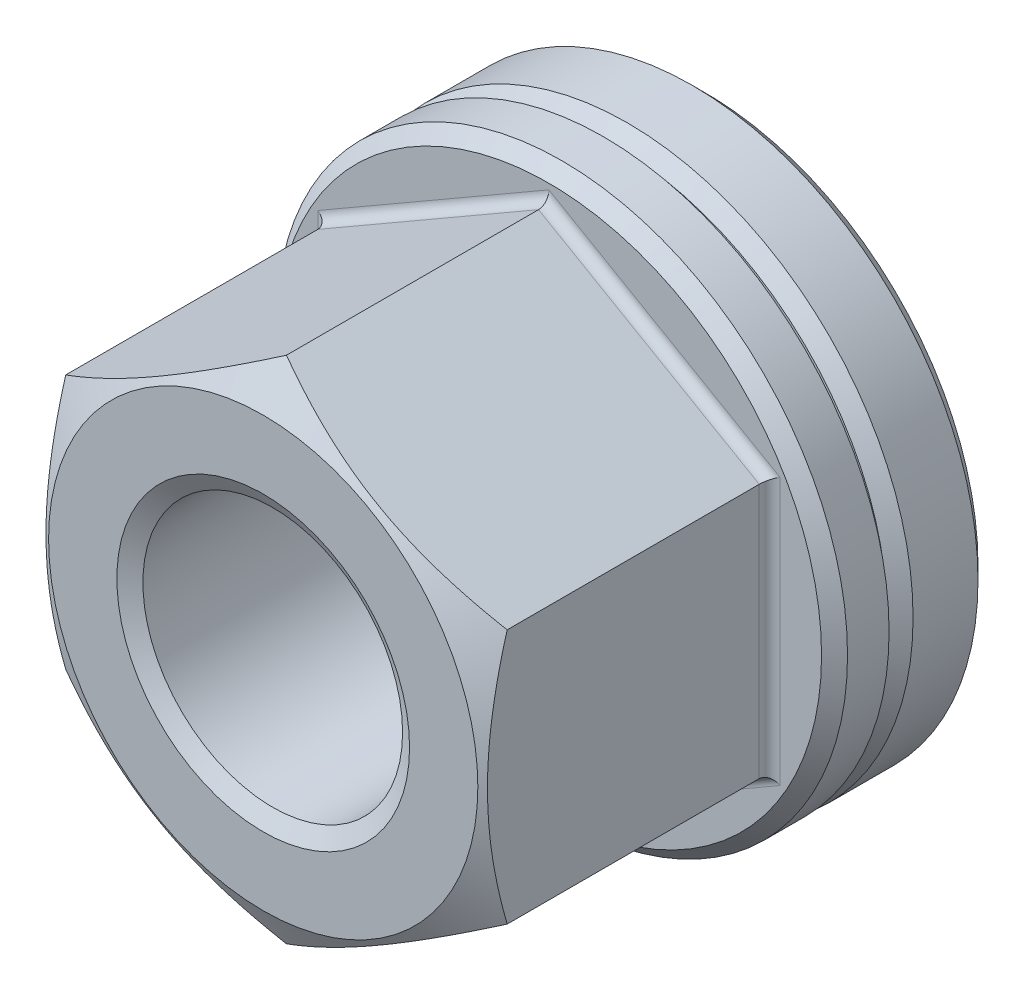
ISO-10303-21;
HEADER;
FILE_DESCRIPTION(('STEP AP214'),'2;1');
FILE_NAME('part.step','',(''),(''),'','','');
FILE_SCHEMA(('AUTOMOTIVE_DESIGN { 1 0 10303 214 1 1 1 1 }'));
ENDSEC;
DATA;
#1=APPLICATION_CONTEXT('core data for automotive mechanical design processes');
#2=APPLICATION_PROTOCOL_DEFINITION('international standard','automotive_design',2000,#1);
#3=PRODUCT_CONTEXT('',#1,'mechanical');
#4=PRODUCT('Part','Part','',(#3));
#5=PRODUCT_RELATED_PRODUCT_CATEGORY('part','',(#4));
#6=PRODUCT_DEFINITION_FORMATION('','',#4);
#7=PRODUCT_DEFINITION_CONTEXT('part definition',#1,'design');
#8=PRODUCT_DEFINITION('design','',#6,#7);
#9=PRODUCT_DEFINITION_SHAPE('','',#8);
#10=(LENGTH_UNIT() NAMED_UNIT(*) SI_UNIT(.MILLI.,.METRE.));
#11=(NAMED_UNIT(*) PLANE_ANGLE_UNIT() SI_UNIT($,.RADIAN.));
#12=(NAMED_UNIT(*) SI_UNIT($,.STERADIAN.) SOLID_ANGLE_UNIT());
#13=UNCERTAINTY_MEASURE_WITH_UNIT(LENGTH_MEASURE(1.E-05),#10,'distance_accuracy_value','');
#14=(GEOMETRIC_REPRESENTATION_CONTEXT(3) GLOBAL_UNCERTAINTY_ASSIGNED_CONTEXT((#13)) GLOBAL_UNIT_ASSIGNED_CONTEXT((#10,
#11,#12)) REPRESENTATION_CONTEXT('',''));
#15=CARTESIAN_POINT('',(0.,0.,0.));
#16=DIRECTION('',(0.,0.,1.));
#17=DIRECTION('',(1.,0.,0.));
#18=AXIS2_PLACEMENT_3D('',#15,#16,#17);
#19=CARTESIAN_POINT('',(0.,0.,26.3737494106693));
#20=DIRECTION('',(0.,0.,-1.));
#21=DIRECTION('',(0.,1.,0.));
#22=AXIS2_PLACEMENT_3D('',#19,#20,#21);
#23=SPHERICAL_SURFACE('',#22,25.);
#24=CARTESIAN_POINT('',(0.,0.,2.0238050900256));
#25=DIRECTION('',(0.,0.,-1.));
#26=DIRECTION('',(-1.,0.,0.));
#27=AXIS2_PLACEMENT_3D('',#24,#25,#26);
#28=CIRCLE('',#27,5.66393958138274);
#29=CARTESIAN_POINT('',(0.,5.66393958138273,2.0238050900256));
#30=VERTEX_POINT('',#29);
#31=EDGE_CURVE('E597',#30,#30,#28,.T.);
#32=CARTESIAN_POINT('',(0.,0.,2.23353400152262));
#33=DIRECTION('',(0.,0.,1.));
#34=DIRECTION('',(1.,0.,0.));
#35=AXIS2_PLACEMENT_3D('',#32,#33,#34);
#36=CIRCLE('',#35,6.5);
#37=CARTESIAN_POINT('',(0.,6.49999999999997,2.23353400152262));
#38=VERTEX_POINT('',#37);
#39=EDGE_CURVE('E23',#38,#38,#36,.T.);
#40=CARTESIAN_POINT('',(0.,5.66393958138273,2.0238050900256));
#41=CARTESIAN_POINT('',(0.,5.67268534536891,2.02583940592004));
#42=CARTESIAN_POINT('',(0.,5.68143001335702,2.02787843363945));
#43=CARTESIAN_POINT('',(0.,5.69891714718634,2.0319659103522));
#44=CARTESIAN_POINT('',(0.,5.70765961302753,2.03401435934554));
#45=CARTESIAN_POINT('',(0.,5.72514233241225,2.03812067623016));
#46=CARTESIAN_POINT('',(0.,5.73388258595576,2.04017854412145));
#47=CARTESIAN_POINT('',(0.,5.75136087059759,2.04430369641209));
#48=CARTESIAN_POINT('',(0.,5.76009890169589,2.04637098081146));
#49=CARTESIAN_POINT('',(0.,5.77757273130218,2.05051496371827));
#50=CARTESIAN_POINT('',(0.,5.78630852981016,2.05259166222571));
#51=CARTESIAN_POINT('',(0.,5.80377788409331,2.05675447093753));
#52=CARTESIAN_POINT('',(0.,5.81251143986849,2.0588405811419));
#53=CARTESIAN_POINT('',(0.,5.82997629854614,2.06302221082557));
#54=CARTESIAN_POINT('',(0.,5.83870760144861,2.06511773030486));
#55=CARTESIAN_POINT('',(0.,5.85616794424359,2.06931817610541));
#56=CARTESIAN_POINT('',(0.,5.8648969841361,2.07142310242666));
#57=CARTESIAN_POINT('',(0.,5.8823527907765,2.07564235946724));
#58=CARTESIAN_POINT('',(0.,5.8910795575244,2.07775669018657));
#59=CARTESIAN_POINT('',(0.,5.90853080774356,2.08199475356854));
#60=CARTESIAN_POINT('',(0.,5.91725529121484,2.08411848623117));
#61=CARTESIAN_POINT('',(0.,5.93470196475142,2.08837535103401));
#62=CARTESIAN_POINT('',(0.,5.94342415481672,2.09050848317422));
#63=CARTESIAN_POINT('',(0.,5.96086623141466,2.09478414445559));
#64=CARTESIAN_POINT('',(0.,5.9695861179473,2.09692667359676));
#65=CARTESIAN_POINT('',(0.,5.9870235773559,2.10122112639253));
#66=CARTESIAN_POINT('',(0.,5.99574115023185,2.10337305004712));
#67=CARTESIAN_POINT('',(0.,6.01317397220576,2.10768628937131));
#68=CARTESIAN_POINT('',(0.,6.02188922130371,2.10984760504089));
#69=CARTESIAN_POINT('',(0.,6.03931738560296,2.11417962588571));
#70=CARTESIAN_POINT('',(0.,6.04803030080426,2.11635033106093));
#71=CARTESIAN_POINT('',(0.,6.0654537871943,2.12070112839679));
#72=CARTESIAN_POINT('',(0.,6.07416435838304,2.12288122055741));
#73=CARTESIAN_POINT('',(0.,6.09158314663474,2.12725078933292));
#74=CARTESIAN_POINT('',(0.,6.10029136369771,2.1294402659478));
#75=CARTESIAN_POINT('',(0.,6.11770543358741,2.13382860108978));
#76=CARTESIAN_POINT('',(0.,6.12641128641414,2.13602745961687));
#77=CARTESIAN_POINT('',(0.,6.14382061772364,2.14043455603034));
#78=CARTESIAN_POINT('',(0.,6.15252409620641,2.14264279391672));
#79=CARTESIAN_POINT('',(0.,6.16992866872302,2.14706864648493));
#80=CARTESIAN_POINT('',(0.,6.17862976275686,2.14928626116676));
#81=CARTESIAN_POINT('',(0.,6.19602955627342,2.15373086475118));
#82=CARTESIAN_POINT('',(0.,6.20472825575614,2.15595785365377));
#83=CARTESIAN_POINT('',(0.,6.22212325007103,2.1604212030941));
#84=CARTESIAN_POINT('',(0.,6.2308195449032,2.16265756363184));
#85=CARTESIAN_POINT('',(0.,6.24820971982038,2.16713965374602));
#86=CARTESIAN_POINT('',(0.,6.25690359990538,2.16938538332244));
#87=CARTESIAN_POINT('',(0.,6.2742889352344,2.17388620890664));
#88=CARTESIAN_POINT('',(0.,6.2829803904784,2.1761413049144));
#89=CARTESIAN_POINT('',(0.,6.30036086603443,2.18066086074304));
#90=CARTESIAN_POINT('',(0.,6.30904988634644,2.18292532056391));
#91=CARTESIAN_POINT('',(0.,6.32642548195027,2.18746360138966));
#92=CARTESIAN_POINT('',(0.,6.3351120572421,2.18973742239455));
#93=CARTESIAN_POINT('',(0.,6.35248275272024,2.19429442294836));
#94=CARTESIAN_POINT('',(0.,6.36116687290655,2.19657760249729));
#95=CARTESIAN_POINT('',(0.,6.37853264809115,2.20115331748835));
#96=CARTESIAN_POINT('',(0.,6.38721430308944,2.20344585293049));
#97=CARTESIAN_POINT('',(0.,6.40457513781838,2.20804027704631));
#98=CARTESIAN_POINT('',(0.,6.41325431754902,2.21034216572));
#99=CARTESIAN_POINT('',(0.,6.43061019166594,2.21495529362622));
#100=CARTESIAN_POINT('',(0.,6.43928688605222,2.21726653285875));
#101=CARTESIAN_POINT('',(0.,6.45663777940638,2.22189835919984));
#102=CARTESIAN_POINT('',(0.,6.46531197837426,2.22421894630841));
#103=CARTESIAN_POINT('',(0.,6.48265787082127,2.22886946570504));
#104=CARTESIAN_POINT('',(0.,6.4913295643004,2.2311993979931));
#105=CARTESIAN_POINT('',(0.,6.49999999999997,2.23353400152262));
#106=B_SPLINE_CURVE_WITH_KNOTS('',3,(#40,#41,#42,#43,#44,#45,#46,#47,#48,#49,#50,#51,#52,#53,
#54,#55,#56,#57,#58,#59,#60,#61,#62,#63,#64,#65,#66,#67,#68,#69,#70,#71,#72,#73,#74,#75,#76,#77,
#78,#79,#80,#81,#82,#83,#84,#85,#86,#87,#88,#89,#90,#91,#92,#93,#94,#95,#96,#97,#98,#99,#100,
#101,#102,#103,#104,#105),.UNSPECIFIED.,.F.,.F.,(4,2,2,2,2,2,2,2,2,2,2,2,2,2,2,2,2,2,2,2,2,2,2,
2,2,2,2,2,2,2,2,2,4),(0.,0.0269377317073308,0.0538754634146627,0.0808131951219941,
0.107750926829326,0.134688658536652,0.161626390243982,0.188564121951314,0.215501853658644,
0.242439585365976,0.269377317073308,0.296315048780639,0.323252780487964,0.350190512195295,
0.377128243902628,0.404065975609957,0.431003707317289,0.45794143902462,0.484879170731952,
0.511816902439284,0.538754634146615,0.565692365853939,0.592630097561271,0.619567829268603,
0.646505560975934,0.673443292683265,0.700381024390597,0.727318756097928,0.754256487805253,
0.781194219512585,0.808131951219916,0.835069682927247,0.862007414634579),.UNSPECIFIED.);
#107=EDGE_CURVE('BSEAM14',#30,#38,#106,.T.);
#108=ORIENTED_EDGE('',*,*,#31,.F.);
#109=ORIENTED_EDGE('',*,*,#39,.F.);
#110=ORIENTED_EDGE('',*,*,#107,.T.);
#111=ORIENTED_EDGE('',*,*,#107,.F.);
#112=EDGE_LOOP('',(#108,#110,#109,#111));
#113=FACE_BOUND('',#112,.T.);
#114=ADVANCED_FACE('F14',(#113),#23,.T.);
#115=CARTESIAN_POINT('',(0.,0.,6.0238050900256));
#116=DIRECTION('',(0.,0.,1.));
#117=DIRECTION('',(1.,0.,0.));
#118=AXIS2_PLACEMENT_3D('',#115,#116,#117);
#119=PLANE('',#118);
#120=DIRECTION('',(0.,-1.,0.));
#121=VECTOR('',#120,1.);
#122=CARTESIAN_POINT('',(-8.9,0.,6.0238050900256));
#123=LINE('',#122,#121);
#124=CARTESIAN_POINT('',(-8.9,-5.13841739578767,6.0238050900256));
#125=VERTEX_POINT('',#124);
#126=CARTESIAN_POINT('',(-8.9,5.13841739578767,6.0238050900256));
#127=VERTEX_POINT('',#126);
#128=EDGE_CURVE('E142',#125,#127,#123,.F.);
#129=ORIENTED_EDGE('',*,*,#128,.T.);
#130=DIRECTION('',(-0.866025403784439,-0.5,0.));
#131=VECTOR('',#130,1.);
#132=CARTESIAN_POINT('',(-4.45,7.70762609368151,6.0238050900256));
#133=LINE('',#132,#131);
#134=CARTESIAN_POINT('',(0.,10.2768347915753,6.0238050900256));
#135=VERTEX_POINT('',#134);
#136=EDGE_CURVE('E144',#127,#135,#133,.F.);
#137=ORIENTED_EDGE('',*,*,#136,.T.);
#138=DIRECTION('',(-0.866025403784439,0.5,0.));
#139=VECTOR('',#138,1.);
#140=CARTESIAN_POINT('',(4.45,7.70762609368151,6.0238050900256));
#141=LINE('',#140,#139);
#142=CARTESIAN_POINT('',(8.9,5.13841739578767,6.0238050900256));
#143=VERTEX_POINT('',#142);
#144=EDGE_CURVE('E134',#135,#143,#141,.F.);
#145=ORIENTED_EDGE('',*,*,#144,.T.);
#146=DIRECTION('',(0.,1.,0.));
#147=VECTOR('',#146,1.);
#148=CARTESIAN_POINT('',(8.9,0.,6.0238050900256));
#149=LINE('',#148,#147);
#150=CARTESIAN_POINT('',(8.9,-5.13841739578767,6.0238050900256));
#151=VERTEX_POINT('',#150);
#152=EDGE_CURVE('E136',#143,#151,#149,.F.);
#153=ORIENTED_EDGE('',*,*,#152,.T.);
#154=DIRECTION('',(0.866025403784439,0.5,0.));
#155=VECTOR('',#154,1.);
#156=CARTESIAN_POINT('',(4.45,-7.7076260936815,6.0238050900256));
#157=LINE('',#156,#155);
#158=CARTESIAN_POINT('',(0.,-10.2768347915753,6.0238050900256));
#159=VERTEX_POINT('',#158);
#160=EDGE_CURVE('E138',#151,#159,#157,.F.);
#161=ORIENTED_EDGE('',*,*,#160,.T.);
#162=DIRECTION('',(0.866025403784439,-0.5,0.));
#163=VECTOR('',#162,1.);
#164=CARTESIAN_POINT('',(-4.45,-7.7076260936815,6.0238050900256));
#165=LINE('',#164,#163);
#166=EDGE_CURVE('E140',#159,#125,#165,.F.);
#167=ORIENTED_EDGE('',*,*,#166,.T.);
#168=EDGE_LOOP('',(#129,#137,#145,#153,#161,#167));
#169=FACE_BOUND('',#168,.T.);
#170=CARTESIAN_POINT('',(0.,0.,6.0238050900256));
#171=DIRECTION('',(0.,0.,1.));
#172=DIRECTION('',(1.,0.,0.));
#173=AXIS2_PLACEMENT_3D('',#170,#171,#172);
#174=CIRCLE('',#173,10.5);
#175=CARTESIAN_POINT('',(10.5,0.,6.0238050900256));
#176=VERTEX_POINT('',#175);
#177=EDGE_CURVE('E116',#176,#176,#174,.T.);
#178=ORIENTED_EDGE('',*,*,#177,.T.);
#179=EDGE_LOOP('',(#178));
#180=FACE_BOUND('',#179,.T.);
#181=ADVANCED_FACE('F508',(#169,#180),#119,.T.);
#182=CARTESIAN_POINT('',(0.,0.,6.0238050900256));
#183=DIRECTION('',(0.,0.,-1.));
#184=DIRECTION('',(-1.,0.,0.));
#185=AXIS2_PLACEMENT_3D('',#182,#183,#184);
#186=CYLINDRICAL_SURFACE('',#185,11.);
#187=CARTESIAN_POINT('',(0.,0.,5.5238050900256));
#188=DIRECTION('',(0.,0.,1.));
#189=DIRECTION('',(1.,0.,0.));
#190=AXIS2_PLACEMENT_3D('',#187,#188,#189);
#191=CIRCLE('',#190,11.);
#192=CARTESIAN_POINT('',(11.,0.,5.5238050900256));
#193=VERTEX_POINT('',#192);
#194=EDGE_CURVE('E124',#193,#193,#191,.F.);
#195=ORIENTED_EDGE('',*,*,#194,.T.);
#196=EDGE_LOOP('',(#195));
#197=FACE_BOUND('',#196,.T.);
#198=CARTESIAN_POINT('',(0.,0.,3.9238050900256));
#199=DIRECTION('',(0.,0.,-1.));
#200=DIRECTION('',(-1.,0.,0.));
#201=AXIS2_PLACEMENT_3D('',#198,#199,#200);
#202=CIRCLE('',#201,11.);
#203=CARTESIAN_POINT('',(0.,11.,3.9238050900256));
#204=VERTEX_POINT('',#203);
#205=EDGE_CURVE('E172',#204,#204,#202,.T.);
#206=ORIENTED_EDGE('',*,*,#205,.F.);
#207=EDGE_LOOP('',(#206));
#208=FACE_BOUND('',#207,.T.);
#209=ADVANCED_FACE('F498',(#197,#208),#186,.T.);
#210=CARTESIAN_POINT('',(8.5,4.90747728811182,17.0238050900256));
#211=DIRECTION('',(-0.5,-0.866025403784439,0.));
#212=DIRECTION('',(0.866025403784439,-0.5,0.));
#213=AXIS2_PLACEMENT_3D('',#210,#211,#212);
#214=PLANE('',#213);
#215=DIRECTION('',(0.,0.,-1.));
#216=VECTOR('',#215,1.);
#217=CARTESIAN_POINT('',(8.5,4.90747728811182,17.0238050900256));
#218=LINE('',#217,#216);
#219=CARTESIAN_POINT('',(8.5,4.90747728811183,16.1289121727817));
#220=VERTEX_POINT('',#219);
#221=CARTESIAN_POINT('',(8.5,4.90747728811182,6.4238050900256));
#222=VERTEX_POINT('',#221);
#223=EDGE_CURVE('E575',#220,#222,#218,.T.);
#224=ORIENTED_EDGE('',*,*,#223,.T.);
#225=DIRECTION('',(-0.866025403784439,0.5,0.));
#226=VECTOR('',#225,1.);
#227=CARTESIAN_POINT('',(8.5,4.90747728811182,6.4238050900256));
#228=LINE('',#227,#226);
#229=CARTESIAN_POINT('',(0.,9.81495457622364,6.4238050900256));
#230=VERTEX_POINT('',#229);
#231=EDGE_CURVE('E153',#222,#230,#228,.T.);
#232=ORIENTED_EDGE('',*,*,#231,.T.);
#233=DIRECTION('',(0.,0.,-1.));
#234=VECTOR('',#233,1.);
#235=CARTESIAN_POINT('',(0.,9.81495457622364,17.0238050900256));
#236=LINE('',#235,#234);
#237=CARTESIAN_POINT('',(0.,9.81495457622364,16.1289121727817));
#238=VERTEX_POINT('',#237);
#239=EDGE_CURVE('E114',#238,#230,#236,.T.);
#240=ORIENTED_EDGE('',*,*,#239,.F.);
#241=CARTESIAN_POINT('',(-0.000200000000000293,9.81507004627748,16.1288455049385));
#242=CARTESIAN_POINT('',(0.186639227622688,9.70719836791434,16.1911154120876));
#243=CARTESIAN_POINT('',(0.374175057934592,9.59892450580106,16.2505592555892));
#244=CARTESIAN_POINT('',(0.750769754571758,9.3814974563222,16.3630164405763));
#245=CARTESIAN_POINT('',(0.939829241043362,9.27234391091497,16.4160270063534));
#246=CARTESIAN_POINT('',(1.51003475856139,8.94313560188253,16.5643681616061));
#247=CARTESIAN_POINT('',(1.89343164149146,8.72178130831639,16.6487426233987));
#248=CARTESIAN_POINT('',(2.46717766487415,8.39052888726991,16.7476815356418));
#249=CARTESIAN_POINT('',(2.65581276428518,8.28162036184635,16.7758663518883));
#250=CARTESIAN_POINT('',(3.0339360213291,8.06331079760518,16.8231274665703));
#251=CARTESIAN_POINT('',(3.22342410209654,7.95390980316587,16.8422045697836));
#252=CARTESIAN_POINT('',(3.6027265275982,7.73491944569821,16.8707667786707));
#253=CARTESIAN_POINT('',(3.79254025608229,7.62533043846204,16.8802627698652));
#254=CARTESIAN_POINT('',(4.17234305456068,7.40605119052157,16.8894591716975));
#255=CARTESIAN_POINT('',(4.36233211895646,7.29636095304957,16.8891598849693));
#256=CARTESIAN_POINT('',(4.71752301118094,7.09129139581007,16.879447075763));
#257=CARTESIAN_POINT('',(4.88274990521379,6.99589760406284,16.871218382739));
#258=CARTESIAN_POINT('',(5.21281671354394,6.80533344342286,16.8475123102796));
#259=CARTESIAN_POINT('',(5.37765660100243,6.71016309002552,16.8320344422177));
#260=CARTESIAN_POINT('',(5.87153810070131,6.4250204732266,16.7750929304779));
#261=CARTESIAN_POINT('',(6.19970550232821,6.23555293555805,16.7231284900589));
#262=CARTESIAN_POINT('',(6.85952142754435,5.8546080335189,16.5932166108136));
#263=CARTESIAN_POINT('',(7.19108574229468,5.66317928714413,16.5147184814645));
#264=CARTESIAN_POINT('',(7.84926989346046,5.28317649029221,16.3365602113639));
#265=CARTESIAN_POINT('',(8.17589815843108,5.09459757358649,16.2369419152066));
#266=CARTESIAN_POINT('',(8.5002,4.90736181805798,16.1288455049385));
#267=B_SPLINE_CURVE_WITH_KNOTS('',3,(#241,#242,#243,#244,#245,#246,#247,#248,#249,#250,#251,
#252,#253,#254,#255,#256,#257,#258,#259,#260,#261,#262,#263,#264,#265,#266),.UNSPECIFIED.,.F.,
.F.,(4,2,2,2,2,2,2,2,2,2,2,2,4),(0.,0.673596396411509,1.34748239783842,2.69805431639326,
3.356799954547,4.01548737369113,4.67342558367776,5.33134346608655,5.90409556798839,
6.47688628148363,7.62328361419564,8.79510569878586,9.96462743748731),.UNSPECIFIED.);
#268=EDGE_CURVE('E95',#238,#220,#267,.T.);
#269=ORIENTED_EDGE('',*,*,#268,.T.);
#270=EDGE_LOOP('',(#224,#232,#240,#269));
#271=FACE_BOUND('',#270,.T.);
#272=ADVANCED_FACE('F489',(#271),#214,.F.);
#273=CARTESIAN_POINT('',(0.,9.81495457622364,17.0238050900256));
#274=DIRECTION('',(0.5,-0.866025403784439,0.));
#275=DIRECTION('',(0.866025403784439,0.5,0.));
#276=AXIS2_PLACEMENT_3D('',#273,#274,#275);
#277=PLANE('',#276);
#278=ORIENTED_EDGE('',*,*,#239,.T.);
#279=DIRECTION('',(-0.866025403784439,-0.5,0.));
#280=VECTOR('',#279,1.);
#281=CARTESIAN_POINT('',(0.,9.81495457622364,6.4238050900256));
#282=LINE('',#281,#280);
#283=CARTESIAN_POINT('',(-8.5,4.90747728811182,6.4238050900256));
#284=VERTEX_POINT('',#283);
#285=EDGE_CURVE('E113',#230,#284,#282,.T.);
#286=ORIENTED_EDGE('',*,*,#285,.T.);
#287=DIRECTION('',(0.,0.,-1.));
#288=VECTOR('',#287,1.);
#289=CARTESIAN_POINT('',(-8.5,4.90747728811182,17.0238050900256));
#290=LINE('',#289,#288);
#291=CARTESIAN_POINT('',(-8.5,4.90747728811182,16.1289121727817));
#292=VERTEX_POINT('',#291);
#293=EDGE_CURVE('E105',#292,#284,#290,.T.);
#294=ORIENTED_EDGE('',*,*,#293,.F.);
#295=CARTESIAN_POINT('',(-8.5002,4.90736181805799,16.1288455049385));
#296=CARTESIAN_POINT('',(-8.31336077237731,5.01523349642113,16.1911154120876));
#297=CARTESIAN_POINT('',(-8.1258249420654,5.12350735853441,16.2505592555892));
#298=CARTESIAN_POINT('',(-7.74923024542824,5.34093440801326,16.3630164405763));
#299=CARTESIAN_POINT('',(-7.56017075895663,5.45008795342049,16.4160270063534));
#300=CARTESIAN_POINT('',(-6.9899652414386,5.77929626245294,16.5643681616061));
#301=CARTESIAN_POINT('',(-6.60656835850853,6.00065055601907,16.6487426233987));
#302=CARTESIAN_POINT('',(-6.03282233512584,6.33190297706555,16.7476815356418));
#303=CARTESIAN_POINT('',(-5.84418723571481,6.44081150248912,16.7758663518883));
#304=CARTESIAN_POINT('',(-5.46606397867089,6.65912106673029,16.8231274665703));
#305=CARTESIAN_POINT('',(-5.27657589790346,6.76852206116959,16.8422045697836));
#306=CARTESIAN_POINT('',(-4.8972734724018,6.98751241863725,16.8707667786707));
#307=CARTESIAN_POINT('',(-4.70745974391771,7.09710142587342,16.8802627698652));
#308=CARTESIAN_POINT('',(-4.32765694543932,7.3163806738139,16.8894591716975));
#309=CARTESIAN_POINT('',(-4.13766788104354,7.42607091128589,16.8891598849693));
#310=CARTESIAN_POINT('',(-3.78247698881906,7.63114046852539,16.879447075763));
#311=CARTESIAN_POINT('',(-3.61725009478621,7.72653426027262,16.871218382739));
#312=CARTESIAN_POINT('',(-3.28718328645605,7.9170984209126,16.8475123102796));
#313=CARTESIAN_POINT('',(-3.12234339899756,8.01226877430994,16.8320344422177));
#314=CARTESIAN_POINT('',(-2.62846189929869,8.29741139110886,16.7750929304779));
#315=CARTESIAN_POINT('',(-2.30029449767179,8.48687892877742,16.7231284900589));
#316=CARTESIAN_POINT('',(-1.64047857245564,8.86782383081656,16.5932166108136));
#317=CARTESIAN_POINT('',(-1.30891425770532,9.05925257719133,16.5147184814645));
#318=CARTESIAN_POINT('',(-0.650730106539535,9.43925537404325,16.3365602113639));
#319=CARTESIAN_POINT('',(-0.324101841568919,9.62783429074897,16.2369419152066));
#320=CARTESIAN_POINT('',(0.00019999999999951,9.81507004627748,16.1288455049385));
#321=B_SPLINE_CURVE_WITH_KNOTS('',3,(#295,#296,#297,#298,#299,#300,#301,#302,#303,#304,#305,
#306,#307,#308,#309,#310,#311,#312,#313,#314,#315,#316,#317,#318,#319,#320),.UNSPECIFIED.,.F.,
.F.,(4,2,2,2,2,2,2,2,2,2,2,2,4),(0.,0.673596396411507,1.34748239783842,2.69805431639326,
3.356799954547,4.01548737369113,4.67342558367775,5.33134346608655,5.90409556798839,
6.47688628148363,7.62328361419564,8.79510569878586,9.96462743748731),.UNSPECIFIED.);
#322=EDGE_CURVE('E89',#292,#238,#321,.T.);
#323=ORIENTED_EDGE('',*,*,#322,.T.);
#324=EDGE_LOOP('',(#278,#286,#294,#323));
#325=FACE_BOUND('',#324,.T.);
#326=ADVANCED_FACE('F111',(#325),#277,.F.);
#327=CARTESIAN_POINT('',(-8.5,4.90747728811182,17.0238050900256));
#328=DIRECTION('',(1.,0.,0.));
#329=DIRECTION('',(0.,0.,-1.));
#330=AXIS2_PLACEMENT_3D('',#327,#328,#329);
#331=PLANE('',#330);
#332=ORIENTED_EDGE('',*,*,#293,.T.);
#333=DIRECTION('',(0.,-1.,0.));
#334=VECTOR('',#333,1.);
#335=CARTESIAN_POINT('',(-8.5,4.90747728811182,6.4238050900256));
#336=LINE('',#335,#334);
#337=CARTESIAN_POINT('',(-8.5,-4.90747728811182,6.4238050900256));
#338=VERTEX_POINT('',#337);
#339=EDGE_CURVE('E147',#284,#338,#336,.T.);
#340=ORIENTED_EDGE('',*,*,#339,.T.);
#341=DIRECTION('',(0.,0.,-1.));
#342=VECTOR('',#341,1.);
#343=CARTESIAN_POINT('',(-8.5,-4.90747728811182,17.0238050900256));
#344=LINE('',#343,#342);
#345=CARTESIAN_POINT('',(-8.5,-4.90747728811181,16.1289121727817));
#346=VERTEX_POINT('',#345);
#347=EDGE_CURVE('E107',#346,#338,#344,.T.);
#348=ORIENTED_EDGE('',*,*,#347,.F.);
#349=CARTESIAN_POINT('',(-8.5,-12.9965401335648,12.829716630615));
#350=CARTESIAN_POINT('',(-8.5,-12.6234881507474,13.0099177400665));
#351=CARTESIAN_POINT('',(-8.5,-12.2495520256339,13.1883217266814));
#352=CARTESIAN_POINT('',(-8.5,-11.499433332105,13.5405080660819));
#353=CARTESIAN_POINT('',(-8.5,-11.1232503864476,13.7142896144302));
#354=CARTESIAN_POINT('',(-8.5,-10.3661184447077,14.0571233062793));
#355=CARTESIAN_POINT('',(-8.5,-9.98515448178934,14.2261425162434));
#356=CARTESIAN_POINT('',(-8.5,-9.2200884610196,14.5568940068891));
#357=CARTESIAN_POINT('',(-8.5,-8.83598656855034,14.7186266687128));
#358=CARTESIAN_POINT('',(-8.5,-8.0593528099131,15.0347508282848));
#359=CARTESIAN_POINT('',(-8.5,-7.66677513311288,15.1890304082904));
#360=CARTESIAN_POINT('',(-8.5,-6.87698368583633,15.4854594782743));
#361=CARTESIAN_POINT('',(-8.5,-6.47976940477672,15.6276076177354));
#362=CARTESIAN_POINT('',(-8.5,-5.68089003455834,15.8959400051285));
#363=CARTESIAN_POINT('',(-8.5,-5.27923652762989,16.0221583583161));
#364=CARTESIAN_POINT('',(-8.5,-4.47023474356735,16.2545220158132));
#365=CARTESIAN_POINT('',(-8.5,-4.06288831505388,16.3606736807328));
#366=CARTESIAN_POINT('',(-8.5,-3.24214687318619,16.5477324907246));
#367=CARTESIAN_POINT('',(-8.5,-2.82875005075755,16.6286319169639));
#368=CARTESIAN_POINT('',(-8.5,-2.20503353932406,16.7269802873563));
#369=CARTESIAN_POINT('',(-8.5,-1.99649903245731,16.7559317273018));
#370=CARTESIAN_POINT('',(-8.5,-1.57845804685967,16.8055978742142));
#371=CARTESIAN_POINT('',(-8.5,-1.36895166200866,16.8263133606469));
#372=CARTESIAN_POINT('',(-8.5,-0.95056931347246,16.8589508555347));
#373=CARTESIAN_POINT('',(-8.5,-0.741697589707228,16.8709269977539));
#374=CARTESIAN_POINT('',(-8.5,-0.323634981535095,16.8860228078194));
#375=CARTESIAN_POINT('',(-8.5,-0.114444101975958,16.8891426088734));
#376=CARTESIAN_POINT('',(-8.5,0.303822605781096,16.8864515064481));
#377=CARTESIAN_POINT('',(-8.5,0.512898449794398,16.880643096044));
#378=CARTESIAN_POINT('',(-8.5,0.930623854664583,16.8602395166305));
#379=CARTESIAN_POINT('',(-8.5,1.13927339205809,16.8456438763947));
#380=CARTESIAN_POINT('',(-8.5,1.64542698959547,16.799881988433));
#381=CARTESIAN_POINT('',(-8.5,1.94253849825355,16.7642881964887));
#382=CARTESIAN_POINT('',(-8.5,2.53442130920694,16.6772690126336));
#383=CARTESIAN_POINT('',(-8.5,2.82919225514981,16.625841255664));
#384=CARTESIAN_POINT('',(-8.5,3.71051475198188,16.4503877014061));
#385=CARTESIAN_POINT('',(-8.5,4.2929229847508,16.3053091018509));
#386=CARTESIAN_POINT('',(-8.5,5.16407148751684,16.0553074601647));
#387=CARTESIAN_POINT('',(-8.5,5.45736733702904,15.9653592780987));
#388=CARTESIAN_POINT('',(-8.5,6.04112572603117,15.7765319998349));
#389=CARTESIAN_POINT('',(-8.5,6.33158800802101,15.6776521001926));
#390=CARTESIAN_POINT('',(-8.5,6.90822935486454,15.4730773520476));
#391=CARTESIAN_POINT('',(-8.5,7.19442334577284,15.3674241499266));
#392=CARTESIAN_POINT('',(-8.5,7.76437809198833,15.1500227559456));
#393=CARTESIAN_POINT('',(-8.5,8.04813965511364,15.0382766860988));
#394=CARTESIAN_POINT('',(-8.5,8.33087741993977,14.9240550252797));
#395=B_SPLINE_CURVE_WITH_KNOTS('',3,(#349,#350,#351,#352,#353,#354,#355,#356,#357,#358,#359,
#360,#361,#362,#363,#364,#365,#366,#367,#368,#369,#370,#371,#372,#373,#374,#375,#376,#377,#378,
#379,#380,#381,#382,#383,#384,#385,#386,#387,#388,#389,#390,#391,#392,#393,#394),.UNSPECIFIED.,
.F.,.F.,(4,2,2,2,2,2,2,2,2,2,2,2,2,2,2,2,2,2,2,2,2,2,4),(0.,1.24290131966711,2.48601754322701,
3.73628054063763,4.98647806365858,6.25173743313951,7.51713747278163,8.7797806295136,
10.0420228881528,11.304650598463,11.9361173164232,12.5675242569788,13.1949861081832,
13.8224385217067,14.4497157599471,15.0770266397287,15.9742244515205,16.871556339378,
18.6696815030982,19.5899463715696,20.5102941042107,21.4254435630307,22.3402763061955),.UNSPECIFIED.);
#396=EDGE_CURVE('E92',#346,#292,#395,.T.);
#397=ORIENTED_EDGE('',*,*,#396,.T.);
#398=EDGE_LOOP('',(#332,#340,#348,#397));
#399=FACE_BOUND('',#398,.T.);
#400=ADVANCED_FACE('F104',(#399),#331,.F.);
#401=CARTESIAN_POINT('',(-8.5,-4.90747728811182,17.0238050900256));
#402=DIRECTION('',(0.5,0.866025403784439,0.));
#403=DIRECTION('',(-0.866025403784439,0.5,0.));
#404=AXIS2_PLACEMENT_3D('',#401,#402,#403);
#405=PLANE('',#404);
#406=ORIENTED_EDGE('',*,*,#347,.T.);
#407=DIRECTION('',(0.866025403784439,-0.5,0.));
#408=VECTOR('',#407,1.);
#409=CARTESIAN_POINT('',(-8.5,-4.90747728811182,6.4238050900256));
#410=LINE('',#409,#408);
#411=CARTESIAN_POINT('',(0.,-9.81495457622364,6.4238050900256));
#412=VERTEX_POINT('',#411);
#413=EDGE_CURVE('E149',#338,#412,#410,.T.);
#414=ORIENTED_EDGE('',*,*,#413,.T.);
#415=DIRECTION('',(0.,0.,-1.));
#416=VECTOR('',#415,1.);
#417=CARTESIAN_POINT('',(0.,-9.81495457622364,17.0238050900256));
#418=LINE('',#417,#416);
#419=CARTESIAN_POINT('',(0.,-9.81495457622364,16.1289121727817));
#420=VERTEX_POINT('',#419);
#421=EDGE_CURVE('E118',#420,#412,#418,.T.);
#422=ORIENTED_EDGE('',*,*,#421,.F.);
#423=CARTESIAN_POINT('',(0.00020000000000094,-9.81507004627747,16.1288455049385));
#424=CARTESIAN_POINT('',(-0.186639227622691,-9.70719836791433,16.1911154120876));
#425=CARTESIAN_POINT('',(-0.374175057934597,-9.59892450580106,16.2505592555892));
#426=CARTESIAN_POINT('',(-0.750769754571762,-9.3814974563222,16.3630164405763));
#427=CARTESIAN_POINT('',(-0.939829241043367,-9.27234391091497,16.4160270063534));
#428=CARTESIAN_POINT('',(-1.5100347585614,-8.94313560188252,16.5643681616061));
#429=CARTESIAN_POINT('',(-1.89343164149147,-8.72178130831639,16.6487426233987));
#430=CARTESIAN_POINT('',(-2.46717766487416,-8.39052888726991,16.7476815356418));
#431=CARTESIAN_POINT('',(-2.65581276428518,-8.28162036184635,16.7758663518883));
#432=CARTESIAN_POINT('',(-3.03393602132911,-8.06331079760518,16.8231274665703));
#433=CARTESIAN_POINT('',(-3.22342410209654,-7.95390980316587,16.8422045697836));
#434=CARTESIAN_POINT('',(-3.6027265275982,-7.73491944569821,16.8707667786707));
#435=CARTESIAN_POINT('',(-3.79254025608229,-7.62533043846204,16.8802627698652));
#436=CARTESIAN_POINT('',(-4.17234305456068,-7.40605119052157,16.8894591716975));
#437=CARTESIAN_POINT('',(-4.36233211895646,-7.29636095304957,16.8891598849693));
#438=CARTESIAN_POINT('',(-4.71752301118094,-7.09129139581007,16.879447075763));
#439=CARTESIAN_POINT('',(-4.88274990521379,-6.99589760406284,16.871218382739));
#440=CARTESIAN_POINT('',(-5.21281671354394,-6.80533344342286,16.8475123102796));
#441=CARTESIAN_POINT('',(-5.37765660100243,-6.71016309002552,16.8320344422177));
#442=CARTESIAN_POINT('',(-5.87153810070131,-6.4250204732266,16.7750929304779));
#443=CARTESIAN_POINT('',(-6.19970550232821,-6.23555293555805,16.7231284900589));
#444=CARTESIAN_POINT('',(-6.85952142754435,-5.8546080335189,16.5932166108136));
#445=CARTESIAN_POINT('',(-7.19108574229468,-5.66317928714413,16.5147184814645));
#446=CARTESIAN_POINT('',(-7.84926989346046,-5.28317649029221,16.3365602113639));
#447=CARTESIAN_POINT('',(-8.17589815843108,-5.09459757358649,16.2369419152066));
#448=CARTESIAN_POINT('',(-8.5002,-4.90736181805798,16.1288455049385));
#449=B_SPLINE_CURVE_WITH_KNOTS('',3,(#423,#424,#425,#426,#427,#428,#429,#430,#431,#432,#433,
#434,#435,#436,#437,#438,#439,#440,#441,#442,#443,#444,#445,#446,#447,#448),.UNSPECIFIED.,.F.,
.F.,(4,2,2,2,2,2,2,2,2,2,2,2,4),(0.,0.673596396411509,1.34748239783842,2.69805431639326,
3.356799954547,4.01548737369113,4.67342558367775,5.33134346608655,5.90409556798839,
6.47688628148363,7.62328361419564,8.79510569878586,9.96462743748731),.UNSPECIFIED.);
#450=EDGE_CURVE('E108',#420,#346,#449,.T.);
#451=ORIENTED_EDGE('',*,*,#450,.T.);
#452=EDGE_LOOP('',(#406,#414,#422,#451));
#453=FACE_BOUND('',#452,.T.);
#454=ADVANCED_FACE('F463',(#453),#405,.F.);
#455=CARTESIAN_POINT('',(0.,-9.81495457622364,17.0238050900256));
#456=DIRECTION('',(-0.5,0.866025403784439,0.));
#457=DIRECTION('',(-0.866025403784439,-0.5,0.));
#458=AXIS2_PLACEMENT_3D('',#455,#456,#457);
#459=PLANE('',#458);
#460=ORIENTED_EDGE('',*,*,#421,.T.);
#461=DIRECTION('',(0.866025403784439,0.5,0.));
#462=VECTOR('',#461,1.);
#463=CARTESIAN_POINT('',(0.,-9.81495457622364,6.4238050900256));
#464=LINE('',#463,#462);
#465=CARTESIAN_POINT('',(8.5,-4.90747728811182,6.4238050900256));
#466=VERTEX_POINT('',#465);
#467=EDGE_CURVE('E39',#412,#466,#464,.T.);
#468=ORIENTED_EDGE('',*,*,#467,.T.);
#469=DIRECTION('',(0.,0.,-1.));
#470=VECTOR('',#469,1.);
#471=CARTESIAN_POINT('',(8.5,-4.90747728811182,17.0238050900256));
#472=LINE('',#471,#470);
#473=CARTESIAN_POINT('',(8.5,-4.90747728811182,16.1289121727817));
#474=VERTEX_POINT('',#473);
#475=EDGE_CURVE('E577',#474,#466,#472,.T.);
#476=ORIENTED_EDGE('',*,*,#475,.F.);
#477=CARTESIAN_POINT('',(8.5002,-4.90736181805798,16.1288455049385));
#478=CARTESIAN_POINT('',(8.31336077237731,-5.01523349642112,16.1911154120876));
#479=CARTESIAN_POINT('',(8.12582494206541,-5.1235073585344,16.2505592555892));
#480=CARTESIAN_POINT('',(7.74923024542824,-5.34093440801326,16.3630164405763));
#481=CARTESIAN_POINT('',(7.56017075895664,-5.45008795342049,16.4160270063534));
#482=CARTESIAN_POINT('',(6.9899652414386,-5.77929626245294,16.5643681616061));
#483=CARTESIAN_POINT('',(6.60656835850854,-6.00065055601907,16.6487426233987));
#484=CARTESIAN_POINT('',(6.03282233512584,-6.33190297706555,16.7476815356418));
#485=CARTESIAN_POINT('',(5.84418723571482,-6.44081150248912,16.7758663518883));
#486=CARTESIAN_POINT('',(5.46606397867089,-6.65912106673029,16.8231274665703));
#487=CARTESIAN_POINT('',(5.27657589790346,-6.76852206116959,16.8422045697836));
#488=CARTESIAN_POINT('',(4.8972734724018,-6.98751241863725,16.8707667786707));
#489=CARTESIAN_POINT('',(4.70745974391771,-7.09710142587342,16.8802627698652));
#490=CARTESIAN_POINT('',(4.32765694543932,-7.3163806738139,16.8894591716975));
#491=CARTESIAN_POINT('',(4.13766788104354,-7.42607091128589,16.8891598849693));
#492=CARTESIAN_POINT('',(3.78247698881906,-7.63114046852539,16.879447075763));
#493=CARTESIAN_POINT('',(3.6172500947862,-7.72653426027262,16.871218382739));
#494=CARTESIAN_POINT('',(3.28718328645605,-7.9170984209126,16.8475123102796));
#495=CARTESIAN_POINT('',(3.12234339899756,-8.01226877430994,16.8320344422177));
#496=CARTESIAN_POINT('',(2.62846189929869,-8.29741139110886,16.7750929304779));
#497=CARTESIAN_POINT('',(2.30029449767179,-8.48687892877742,16.7231284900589));
#498=CARTESIAN_POINT('',(1.64047857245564,-8.86782383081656,16.5932166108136));
#499=CARTESIAN_POINT('',(1.30891425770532,-9.05925257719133,16.5147184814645));
#500=CARTESIAN_POINT('',(0.650730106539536,-9.43925537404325,16.3365602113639));
#501=CARTESIAN_POINT('',(0.32410184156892,-9.62783429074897,16.2369419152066));
#502=CARTESIAN_POINT('',(-0.000199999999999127,-9.81507004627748,16.1288455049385));
#503=B_SPLINE_CURVE_WITH_KNOTS('',3,(#477,#478,#479,#480,#481,#482,#483,#484,#485,#486,#487,
#488,#489,#490,#491,#492,#493,#494,#495,#496,#497,#498,#499,#500,#501,#502),.UNSPECIFIED.,.F.,
.F.,(4,2,2,2,2,2,2,2,2,2,2,2,4),(0.,0.673596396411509,1.34748239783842,2.69805431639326,
3.356799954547,4.01548737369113,4.67342558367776,5.33134346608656,5.9040955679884,
6.47688628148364,7.62328361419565,8.79510569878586,9.96462743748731),.UNSPECIFIED.);
#504=EDGE_CURVE('E545',#474,#420,#503,.T.);
#505=ORIENTED_EDGE('',*,*,#504,.T.);
#506=EDGE_LOOP('',(#460,#468,#476,#505));
#507=FACE_BOUND('',#506,.T.);
#508=ADVANCED_FACE('F454',(#507),#459,.F.);
#509=CARTESIAN_POINT('',(8.5,-4.90747728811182,17.0238050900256));
#510=DIRECTION('',(-1.,0.,0.));
#511=DIRECTION('',(0.,0.,1.));
#512=AXIS2_PLACEMENT_3D('',#509,#510,#511);
#513=PLANE('',#512);
#514=ORIENTED_EDGE('',*,*,#475,.T.);
#515=DIRECTION('',(0.,1.,0.));
#516=VECTOR('',#515,1.);
#517=CARTESIAN_POINT('',(8.5,-4.90747728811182,6.4238050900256));
#518=LINE('',#517,#516);
#519=EDGE_CURVE('E31',#466,#222,#518,.T.);
#520=ORIENTED_EDGE('',*,*,#519,.T.);
#521=ORIENTED_EDGE('',*,*,#223,.F.);
#522=CARTESIAN_POINT('',(8.5,-12.9965401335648,12.829716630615));
#523=CARTESIAN_POINT('',(8.5,-12.6234881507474,13.0099177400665));
#524=CARTESIAN_POINT('',(8.5,-12.2495520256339,13.1883217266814));
#525=CARTESIAN_POINT('',(8.5,-11.499433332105,13.5405080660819));
#526=CARTESIAN_POINT('',(8.5,-11.1232503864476,13.7142896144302));
#527=CARTESIAN_POINT('',(8.5,-10.3661184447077,14.0571233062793));
#528=CARTESIAN_POINT('',(8.5,-9.98515448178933,14.2261425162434));
#529=CARTESIAN_POINT('',(8.5,-9.22008846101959,14.5568940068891));
#530=CARTESIAN_POINT('',(8.5,-8.83598656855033,14.7186266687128));
#531=CARTESIAN_POINT('',(8.5,-8.05935280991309,15.0347508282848));
#532=CARTESIAN_POINT('',(8.5,-7.66677513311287,15.1890304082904));
#533=CARTESIAN_POINT('',(8.5,-6.87698368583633,15.4854594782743));
#534=CARTESIAN_POINT('',(8.5,-6.47976940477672,15.6276076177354));
#535=CARTESIAN_POINT('',(8.5,-5.68089003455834,15.8959400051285));
#536=CARTESIAN_POINT('',(8.5,-5.27923652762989,16.0221583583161));
#537=CARTESIAN_POINT('',(8.5,-4.47023474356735,16.2545220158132));
#538=CARTESIAN_POINT('',(8.5,-4.06288831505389,16.3606736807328));
#539=CARTESIAN_POINT('',(8.5,-3.2421468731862,16.5477324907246));
#540=CARTESIAN_POINT('',(8.5,-2.82875005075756,16.6286319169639));
#541=CARTESIAN_POINT('',(8.5,-2.20503353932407,16.7269802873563));
#542=CARTESIAN_POINT('',(8.5,-1.99649903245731,16.7559317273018));
#543=CARTESIAN_POINT('',(8.5,-1.57845804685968,16.8055978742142));
#544=CARTESIAN_POINT('',(8.5,-1.36895166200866,16.8263133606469));
#545=CARTESIAN_POINT('',(8.5,-0.950569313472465,16.8589508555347));
#546=CARTESIAN_POINT('',(8.5,-0.741697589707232,16.8709269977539));
#547=CARTESIAN_POINT('',(8.5,-0.3236349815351,16.8860228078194));
#548=CARTESIAN_POINT('',(8.5,-0.114444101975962,16.8891426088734));
#549=CARTESIAN_POINT('',(8.5,0.303822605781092,16.8864515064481));
#550=CARTESIAN_POINT('',(8.5,0.512898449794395,16.880643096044));
#551=CARTESIAN_POINT('',(8.5,0.930623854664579,16.8602395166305));
#552=CARTESIAN_POINT('',(8.5,1.13927339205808,16.8456438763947));
#553=CARTESIAN_POINT('',(8.5,1.64542698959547,16.799881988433));
#554=CARTESIAN_POINT('',(8.5,1.94253849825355,16.7642881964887));
#555=CARTESIAN_POINT('',(8.5,2.53442130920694,16.6772690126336));
#556=CARTESIAN_POINT('',(8.5,2.82919225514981,16.625841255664));
#557=CARTESIAN_POINT('',(8.5,3.71051475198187,16.4503877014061));
#558=CARTESIAN_POINT('',(8.5,4.29292298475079,16.3053091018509));
#559=CARTESIAN_POINT('',(8.5,5.16407148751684,16.0553074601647));
#560=CARTESIAN_POINT('',(8.5,5.45736733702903,15.9653592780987));
#561=CARTESIAN_POINT('',(8.5,6.04112572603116,15.7765319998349));
#562=CARTESIAN_POINT('',(8.5,6.33158800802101,15.6776521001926));
#563=CARTESIAN_POINT('',(8.5,6.90822935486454,15.4730773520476));
#564=CARTESIAN_POINT('',(8.5,7.19442334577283,15.3674241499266));
#565=CARTESIAN_POINT('',(8.5,7.76437809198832,15.1500227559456));
#566=CARTESIAN_POINT('',(8.5,8.04813965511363,15.0382766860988));
#567=CARTESIAN_POINT('',(8.5,8.33087741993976,14.9240550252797));
#568=B_SPLINE_CURVE_WITH_KNOTS('',3,(#522,#523,#524,#525,#526,#527,#528,#529,#530,#531,#532,
#533,#534,#535,#536,#537,#538,#539,#540,#541,#542,#543,#544,#545,#546,#547,#548,#549,#550,#551,
#552,#553,#554,#555,#556,#557,#558,#559,#560,#561,#562,#563,#564,#565,#566,#567),.UNSPECIFIED.,
.F.,.F.,(4,2,2,2,2,2,2,2,2,2,2,2,2,2,2,2,2,2,2,2,2,2,4),(0.,1.24290131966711,2.48601754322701,
3.73628054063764,4.98647806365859,6.25173743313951,7.51713747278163,8.7797806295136,
10.0420228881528,11.304650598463,11.9361173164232,12.5675242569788,13.1949861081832,
13.8224385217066,14.4497157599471,15.0770266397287,15.9742244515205,16.871556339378,
18.6696815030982,19.5899463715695,20.5102941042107,21.4254435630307,22.3402763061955),.UNSPECIFIED.);
#569=EDGE_CURVE('E535',#220,#474,#568,.F.);
#570=ORIENTED_EDGE('',*,*,#569,.T.);
#571=EDGE_LOOP('',(#514,#520,#521,#570));
#572=FACE_BOUND('',#571,.T.);
#573=ADVANCED_FACE('F444',(#572),#513,.F.);
#574=CARTESIAN_POINT('',(0.,0.,17.0238050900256));
#575=DIRECTION('',(0.,0.,-1.));
#576=DIRECTION('',(-1.,0.,0.));
#577=AXIS2_PLACEMENT_3D('',#574,#575,#576);
#578=CONICAL_SURFACE('',#577,8.26495457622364,1.0471975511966);
#579=CARTESIAN_POINT('',(0.,0.,17.0238050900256));
#580=DIRECTION('',(0.,0.,-1.));
#581=DIRECTION('',(-1.,0.,0.));
#582=AXIS2_PLACEMENT_3D('',#579,#580,#581);
#583=CIRCLE('',#582,8.26495457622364);
#584=CARTESIAN_POINT('',(-8.26495457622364,0.,17.0238050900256));
#585=VERTEX_POINT('',#584);
#586=EDGE_CURVE('E595',#585,#585,#583,.T.);
#587=ORIENTED_EDGE('',*,*,#586,.T.);
#588=EDGE_LOOP('',(#587));
#589=FACE_BOUND('',#588,.T.);
#590=ORIENTED_EDGE('',*,*,#322,.F.);
#591=ORIENTED_EDGE('',*,*,#396,.F.);
#592=ORIENTED_EDGE('',*,*,#450,.F.);
#593=ORIENTED_EDGE('',*,*,#504,.F.);
#594=ORIENTED_EDGE('',*,*,#569,.F.);
#595=ORIENTED_EDGE('',*,*,#268,.F.);
#596=EDGE_LOOP('',(#590,#591,#592,#593,#594,#595));
#597=FACE_BOUND('',#596,.T.);
#598=ADVANCED_FACE('F91',(#589,#597),#578,.T.);
#599=CARTESIAN_POINT('',(0.,9.81495457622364,17.0238050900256));
#600=DIRECTION('',(0.,0.,1.));
#601=DIRECTION('',(1.,0.,0.));
#602=AXIS2_PLACEMENT_3D('',#599,#600,#601);
#603=PLANE('',#602);
#604=CARTESIAN_POINT('',(0.,0.,17.0238050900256));
#605=DIRECTION('',(0.,0.,1.));
#606=DIRECTION('',(1.,0.,0.));
#607=AXIS2_PLACEMENT_3D('',#604,#605,#606);
#608=CIRCLE('',#607,5.63564064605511);
#609=CARTESIAN_POINT('',(5.63564064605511,0.,17.0238050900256));
#610=VERTEX_POINT('',#609);
#611=EDGE_CURVE('E130',#610,#610,#608,.F.);
#612=ORIENTED_EDGE('',*,*,#611,.T.);
#613=EDGE_LOOP('',(#612));
#614=FACE_BOUND('',#613,.T.);
#615=ORIENTED_EDGE('',*,*,#586,.F.);
#616=EDGE_LOOP('',(#615));
#617=FACE_BOUND('',#616,.T.);
#618=ADVANCED_FACE('F425',(#614,#617),#603,.T.);
#619=CARTESIAN_POINT('',(0.,0.,3.5));
#620=DIRECTION('',(0.,0.,1.));
#621=DIRECTION('',(1.,0.,0.));
#622=AXIS2_PLACEMENT_3D('',#619,#620,#621);
#623=CIRCLE('',#622,10.0891817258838);
#624=CARTESIAN_POINT('',(0.,10.0891817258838,3.5));
#625=VERTEX_POINT('',#624);
#626=EDGE_CURVE('E9',#625,#625,#623,.T.);
#627=CARTESIAN_POINT('',(0.,10.0891817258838,3.5));
#628=CARTESIAN_POINT('',(0.,10.0987568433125,3.50422340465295));
#629=CARTESIAN_POINT('',(0.,10.1083293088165,3.50845282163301));
#630=CARTESIAN_POINT('',(0.,10.127468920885,3.51692367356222));
#631=CARTESIAN_POINT('',(0.,10.1370360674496,3.52116510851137));
#632=CARTESIAN_POINT('',(0.,10.1561650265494,3.52965998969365));
#633=CARTESIAN_POINT('',(0.,10.1657268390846,3.53391343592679));
#634=CARTESIAN_POINT('',(0.,10.1848451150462,3.5424323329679));
#635=CARTESIAN_POINT('',(0.,10.1944015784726,3.54669778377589));
#636=CARTESIAN_POINT('',(0.,10.2135091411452,3.55524068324));
#637=CARTESIAN_POINT('',(0.,10.2230602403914,3.55951813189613));
#638=CARTESIAN_POINT('',(0.,10.2421570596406,3.56808502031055));
#639=CARTESIAN_POINT('',(0.,10.2517027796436,3.57237446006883));
#640=CARTESIAN_POINT('',(0.,10.2707888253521,3.58096532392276));
#641=CARTESIAN_POINT('',(0.,10.2803291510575,3.5852667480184));
#642=CARTESIAN_POINT('',(0.,10.2994043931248,3.5938815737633));
#643=CARTESIAN_POINT('',(0.,10.3089393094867,3.59819497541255));
#644=CARTESIAN_POINT('',(0.,10.3280037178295,3.60683374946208));
#645=CARTESIAN_POINT('',(0.,10.3375332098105,3.61115912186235));
#646=CARTESIAN_POINT('',(0.,10.3565867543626,3.6198218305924));
#647=CARTESIAN_POINT('',(0.,10.3661108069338,3.62415916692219));
#648=CARTESIAN_POINT('',(0.,10.3851534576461,3.63284579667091));
#649=CARTESIAN_POINT('',(0.,10.3946720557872,3.63719509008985));
#650=CARTESIAN_POINT('',(0.,10.4137037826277,3.64590562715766));
#651=CARTESIAN_POINT('',(0.,10.4232169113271,3.65026687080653));
#652=CARTESIAN_POINT('',(0.,10.4422376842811,3.65900130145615));
#653=CARTESIAN_POINT('',(0.,10.4517453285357,3.66337448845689));
#654=CARTESIAN_POINT('',(0.,10.4707551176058,3.67213279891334));
#655=CARTESIAN_POINT('',(0.,10.4802572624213,3.67651792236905));
#656=CARTESIAN_POINT('',(0.,10.4992560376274,3.68530009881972));
#657=CARTESIAN_POINT('',(0.,10.508752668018,3.68969715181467));
#658=CARTESIAN_POINT('',(0.,10.5277403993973,3.69850318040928));
#659=CARTESIAN_POINT('',(0.,10.537231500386,3.70291215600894));
#660=CARTESIAN_POINT('',(0.,10.5562081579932,3.71174202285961));
#661=CARTESIAN_POINT('',(0.,10.5656937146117,3.71616291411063));
#662=CARTESIAN_POINT('',(0.,10.5846592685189,3.72501660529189));
#663=CARTESIAN_POINT('',(0.,10.5941392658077,3.72944940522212));
#664=CARTESIAN_POINT('',(0.,10.6130936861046,3.73832690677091));
#665=CARTESIAN_POINT('',(0.,10.6225681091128,3.74277160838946));
#666=CARTESIAN_POINT('',(0.,10.6415113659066,3.75167290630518));
#667=CARTESIAN_POINT('',(0.,10.6509801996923,3.75612950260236));
#668=CARTESIAN_POINT('',(0.,10.6699122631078,3.76505458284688));
#669=CARTESIAN_POINT('',(0.,10.6793754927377,3.76952306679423));
#670=CARTESIAN_POINT('',(0.,10.6982963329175,3.77847191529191));
#671=CARTESIAN_POINT('',(0.,10.7077539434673,3.78295227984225));
#672=CARTESIAN_POINT('',(0.,10.7266635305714,3.79192488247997));
#673=CARTESIAN_POINT('',(0.,10.7361155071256,3.79641712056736));
#674=CARTESIAN_POINT('',(0.,10.755013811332,3.80541346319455));
#675=CARTESIAN_POINT('',(0.,10.7644601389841,3.80991756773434));
#676=CARTESIAN_POINT('',(0.,10.7833471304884,3.81893763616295));
#677=CARTESIAN_POINT('',(0.,10.7927877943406,3.82345360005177));
#678=CARTESIAN_POINT('',(0.,10.8116634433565,3.83249738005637));
#679=CARTESIAN_POINT('',(0.,10.8210984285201,3.83702519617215));
#680=CARTESIAN_POINT('',(0.,10.839962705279,3.8460926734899));
#681=CARTESIAN_POINT('',(0.,10.8493919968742,3.85063233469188));
#682=CARTESIAN_POINT('',(0.,10.8682448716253,3.85972349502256));
#683=CARTESIAN_POINT('',(0.,10.8776684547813,3.86427499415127));
#684=CARTESIAN_POINT('',(0.,10.8965098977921,3.87338982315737));
#685=CARTESIAN_POINT('',(0.,10.905927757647,3.87795315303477));
#686=CARTESIAN_POINT('',(0.,10.924757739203,3.88709163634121));
#687=CARTESIAN_POINT('',(0.,10.9341698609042,3.89166678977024));
#688=CARTESIAN_POINT('',(0.,10.9529883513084,3.90082891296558));
#689=CARTESIAN_POINT('',(0.,10.9623947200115,3.90541588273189));
#690=CARTESIAN_POINT('',(0.,10.981201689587,3.91460163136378));
#691=CARTESIAN_POINT('',(0.,10.9906022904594,3.91920041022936));
#692=CARTESIAN_POINT('',(0.,11.,3.9238050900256));
#693=B_SPLINE_CURVE_WITH_KNOTS('',3,(#627,#628,#629,#630,#631,#632,#633,#634,#635,#636,#637,
#638,#639,#640,#641,#642,#643,#644,#645,#646,#647,#648,#649,#650,#651,#652,#653,#654,#655,#656,
#657,#658,#659,#660,#661,#662,#663,#664,#665,#666,#667,#668,#669,#670,#671,#672,#673,#674,#675,
#676,#677,#678,#679,#680,#681,#682,#683,#684,#685,#686,#687,#688,#689,#690,#691,#692),
.UNSPECIFIED.,.F.,.F.,(4,2,2,2,2,2,2,2,2,2,2,2,2,2,2,2,2,2,2,2,2,2,2,2,2,2,2,2,2,2,2,2,4),(0.,
0.0313955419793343,0.0627910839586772,0.0941866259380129,0.125582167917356,0.156977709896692,
0.18837325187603,0.21976879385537,0.251164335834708,0.282559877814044,0.313955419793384,
0.345350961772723,0.376746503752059,0.408142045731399,0.439537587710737,0.470933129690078,
0.502328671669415,0.533724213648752,0.565119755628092,0.59651529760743,0.627910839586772,
0.659306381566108,0.690701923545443,0.722097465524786,0.753493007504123,0.784888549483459,
0.816284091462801,0.847679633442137,0.879075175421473,0.910470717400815,0.941866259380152,
0.973261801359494,1.00465734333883),.UNSPECIFIED.);
#694=EDGE_CURVE('BSEAM415',#625,#204,#693,.T.);
#695=ORIENTED_EDGE('',*,*,#626,.T.);
#696=ORIENTED_EDGE('',*,*,#205,.T.);
#697=ORIENTED_EDGE('',*,*,#694,.T.);
#698=ORIENTED_EDGE('',*,*,#694,.F.);
#699=EDGE_LOOP('',(#695,#697,#696,#698));
#700=FACE_BOUND('',#699,.T.);
#701=ADVANCED_FACE('F415',(#700),#23,.T.);
#702=CARTESIAN_POINT('',(0.,0.,2.0238050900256));
#703=DIRECTION('',(0.,0.,1.));
#704=DIRECTION('',(1.,0.,0.));
#705=AXIS2_PLACEMENT_3D('',#702,#703,#704);
#706=PLANE('',#705);
#707=CARTESIAN_POINT('',(0.,0.,2.0238050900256));
#708=DIRECTION('',(0.,0.,1.));
#709=DIRECTION('',(1.,0.,0.));
#710=AXIS2_PLACEMENT_3D('',#707,#708,#709);
#711=CIRCLE('',#710,5.6356406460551);
#712=CARTESIAN_POINT('',(5.6356406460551,0.,2.0238050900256));
#713=VERTEX_POINT('',#712);
#714=EDGE_CURVE('E127',#713,#713,#711,.T.);
#715=ORIENTED_EDGE('',*,*,#714,.T.);
#716=EDGE_LOOP('',(#715));
#717=FACE_BOUND('',#716,.T.);
#718=ORIENTED_EDGE('',*,*,#31,.T.);
#719=EDGE_LOOP('',(#718));
#720=FACE_BOUND('',#719,.T.);
#721=ADVANCED_FACE('F405',(#717,#720),#706,.F.);
#722=CARTESIAN_POINT('',(0.,0.,6.0238050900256));
#723=DIRECTION('',(0.,0.,-1.));
#724=DIRECTION('',(-1.,0.,0.));
#725=AXIS2_PLACEMENT_3D('',#722,#723,#724);
#726=CONICAL_SURFACE('',#725,10.5,0.785398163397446);
#727=ORIENTED_EDGE('',*,*,#194,.F.);
#728=EDGE_LOOP('',(#727));
#729=FACE_BOUND('',#728,.T.);
#730=ORIENTED_EDGE('',*,*,#177,.F.);
#731=EDGE_LOOP('',(#730));
#732=FACE_BOUND('',#731,.T.);
#733=ADVANCED_FACE('F395',(#729,#732),#726,.T.);
#734=CARTESIAN_POINT('',(0.,0.,2.0238050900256));
#735=DIRECTION('',(0.,0.,-1.));
#736=DIRECTION('',(-1.,0.,0.));
#737=AXIS2_PLACEMENT_3D('',#734,#735,#736);
#738=CONICAL_SURFACE('',#737,5.6356406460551,1.0471975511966);
#739=CARTESIAN_POINT('',(0.,0.,2.39079238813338));
#740=DIRECTION('',(0.,0.,-1.));
#741=DIRECTION('',(-1.,0.,0.));
#742=AXIS2_PLACEMENT_3D('',#739,#740,#741);
#743=CIRCLE('',#742,5.);
#744=CARTESIAN_POINT('',(-5.,0.,2.39079238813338));
#745=VERTEX_POINT('',#744);
#746=EDGE_CURVE('E158',#745,#745,#743,.T.);
#747=ORIENTED_EDGE('',*,*,#746,.F.);
#748=EDGE_LOOP('',(#747));
#749=FACE_BOUND('',#748,.T.);
#750=ORIENTED_EDGE('',*,*,#714,.F.);
#751=EDGE_LOOP('',(#750));
#752=FACE_BOUND('',#751,.T.);
#753=ADVANCED_FACE('F385',(#749,#752),#738,.F.);
#754=CARTESIAN_POINT('',(0.,0.,16.2238050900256));
#755=DIRECTION('',(0.,0.,1.));
#756=DIRECTION('',(1.,0.,0.));
#757=AXIS2_PLACEMENT_3D('',#754,#755,#756);
#758=CONICAL_SURFACE('',#757,4.25,1.0471975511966);
#759=CARTESIAN_POINT('',(0.,0.,16.6568177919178));
#760=DIRECTION('',(0.,0.,1.));
#761=DIRECTION('',(1.,0.,0.));
#762=AXIS2_PLACEMENT_3D('',#759,#760,#761);
#763=CIRCLE('',#762,5.);
#764=CARTESIAN_POINT('',(5.,0.,16.6568177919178));
#765=VERTEX_POINT('',#764);
#766=EDGE_CURVE('E173',#765,#765,#763,.T.);
#767=ORIENTED_EDGE('',*,*,#766,.F.);
#768=EDGE_LOOP('',(#767));
#769=FACE_BOUND('',#768,.T.);
#770=ORIENTED_EDGE('',*,*,#611,.F.);
#771=EDGE_LOOP('',(#770));
#772=FACE_BOUND('',#771,.T.);
#773=ADVANCED_FACE('F376',(#769,#772),#758,.F.);
#774=CARTESIAN_POINT('',(0.2,-10.1613647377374,6.4238050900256));
#775=DIRECTION('',(0.866025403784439,0.5,0.));
#776=DIRECTION('',(-0.5,0.866025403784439,0.));
#777=AXIS2_PLACEMENT_3D('',#774,#775,#776);
#778=CYLINDRICAL_SURFACE('',#777,0.4);
#779=CARTESIAN_POINT('',(0.,-10.2768347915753,6.4238050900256));
#780=DIRECTION('',(1.,0.,0.));
#781=DIRECTION('',(0.,1.,0.));
#782=AXIS2_PLACEMENT_3D('',#779,#780,#781);
#783=ELLIPSE('',#782,0.461880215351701,0.4);
#784=EDGE_CURVE('E166',#159,#412,#783,.T.);
#785=ORIENTED_EDGE('',*,*,#784,.F.);
#786=ORIENTED_EDGE('',*,*,#160,.F.);
#787=CARTESIAN_POINT('',(8.9,-5.13841739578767,6.4238050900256));
#788=DIRECTION('',(0.5,0.866025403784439,0.));
#789=DIRECTION('',(-0.866025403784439,0.5,0.));
#790=AXIS2_PLACEMENT_3D('',#787,#788,#789);
#791=ELLIPSE('',#790,0.461880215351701,0.4);
#792=EDGE_CURVE('E169',#466,#151,#791,.F.);
#793=ORIENTED_EDGE('',*,*,#792,.F.);
#794=ORIENTED_EDGE('',*,*,#467,.F.);
#795=EDGE_LOOP('',(#785,#786,#793,#794));
#796=FACE_BOUND('',#795,.T.);
#797=ADVANCED_FACE('F254',(#796),#778,.F.);
#798=CARTESIAN_POINT('',(8.9,-4.90747728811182,6.4238050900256));
#799=DIRECTION('',(0.,1.,0.));
#800=DIRECTION('',(0.,0.,1.));
#801=AXIS2_PLACEMENT_3D('',#798,#799,#800);
#802=CYLINDRICAL_SURFACE('',#801,0.4);
#803=ORIENTED_EDGE('',*,*,#792,.T.);
#804=ORIENTED_EDGE('',*,*,#152,.F.);
#805=CARTESIAN_POINT('',(8.9,5.13841739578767,6.4238050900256));
#806=DIRECTION('',(-0.5,0.866025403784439,0.));
#807=DIRECTION('',(-0.866025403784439,-0.5,0.));
#808=AXIS2_PLACEMENT_3D('',#805,#806,#807);
#809=ELLIPSE('',#808,0.461880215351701,0.4);
#810=EDGE_CURVE('E163',#222,#143,#809,.F.);
#811=ORIENTED_EDGE('',*,*,#810,.F.);
#812=ORIENTED_EDGE('',*,*,#519,.F.);
#813=EDGE_LOOP('',(#803,#804,#811,#812));
#814=FACE_BOUND('',#813,.T.);
#815=ADVANCED_FACE('F358',(#814),#802,.F.);
#816=CARTESIAN_POINT('',(-8.7,-5.25388744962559,6.4238050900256));
#817=DIRECTION('',(0.866025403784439,-0.5,0.));
#818=DIRECTION('',(0.5,0.866025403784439,0.));
#819=AXIS2_PLACEMENT_3D('',#816,#817,#818);
#820=CYLINDRICAL_SURFACE('',#819,0.4);
#821=ORIENTED_EDGE('',*,*,#784,.T.);
#822=ORIENTED_EDGE('',*,*,#413,.F.);
#823=CARTESIAN_POINT('',(-8.9,-5.13841739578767,6.4238050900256));
#824=DIRECTION('',(0.5,-0.866025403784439,0.));
#825=DIRECTION('',(0.866025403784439,0.5,0.));
#826=AXIS2_PLACEMENT_3D('',#823,#824,#825);
#827=ELLIPSE('',#826,0.461880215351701,0.4);
#828=EDGE_CURVE('E160',#125,#338,#827,.T.);
#829=ORIENTED_EDGE('',*,*,#828,.F.);
#830=ORIENTED_EDGE('',*,*,#166,.F.);
#831=EDGE_LOOP('',(#821,#822,#829,#830));
#832=FACE_BOUND('',#831,.T.);
#833=ADVANCED_FACE('F348',(#832),#820,.F.);
#834=CARTESIAN_POINT('',(8.7,5.2538874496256,6.4238050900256));
#835=DIRECTION('',(-0.866025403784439,0.5,0.));
#836=DIRECTION('',(-0.5,-0.866025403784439,0.));
#837=AXIS2_PLACEMENT_3D('',#834,#835,#836);
#838=CYLINDRICAL_SURFACE('',#837,0.4);
#839=ORIENTED_EDGE('',*,*,#810,.T.);
#840=ORIENTED_EDGE('',*,*,#144,.F.);
#841=CARTESIAN_POINT('',(0.,10.2768347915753,6.4238050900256));
#842=DIRECTION('',(-1.,0.,0.));
#843=DIRECTION('',(0.,1.,0.));
#844=AXIS2_PLACEMENT_3D('',#841,#842,#843);
#845=ELLIPSE('',#844,0.461880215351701,0.4);
#846=EDGE_CURVE('E157',#230,#135,#845,.F.);
#847=ORIENTED_EDGE('',*,*,#846,.F.);
#848=ORIENTED_EDGE('',*,*,#231,.F.);
#849=EDGE_LOOP('',(#839,#840,#847,#848));
#850=FACE_BOUND('',#849,.T.);
#851=ADVANCED_FACE('F338',(#850),#838,.F.);
#852=CARTESIAN_POINT('',(-8.9,4.90747728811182,6.4238050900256));
#853=DIRECTION('',(0.,-1.,0.));
#854=DIRECTION('',(0.,0.,-1.));
#855=AXIS2_PLACEMENT_3D('',#852,#853,#854);
#856=CYLINDRICAL_SURFACE('',#855,0.4);
#857=ORIENTED_EDGE('',*,*,#828,.T.);
#858=ORIENTED_EDGE('',*,*,#339,.F.);
#859=CARTESIAN_POINT('',(-8.9,5.13841739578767,6.4238050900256));
#860=DIRECTION('',(-0.5,-0.866025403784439,0.));
#861=DIRECTION('',(0.866025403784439,-0.5,0.));
#862=AXIS2_PLACEMENT_3D('',#859,#860,#861);
#863=ELLIPSE('',#862,0.461880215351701,0.4);
#864=EDGE_CURVE('E155',#127,#284,#863,.T.);
#865=ORIENTED_EDGE('',*,*,#864,.F.);
#866=ORIENTED_EDGE('',*,*,#128,.F.);
#867=EDGE_LOOP('',(#857,#858,#865,#866));
#868=FACE_BOUND('',#867,.T.);
#869=ADVANCED_FACE('F328',(#868),#856,.F.);
#870=CARTESIAN_POINT('',(-0.2,10.1613647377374,6.4238050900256));
#871=DIRECTION('',(-0.866025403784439,-0.5,0.));
#872=DIRECTION('',(0.5,-0.866025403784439,0.));
#873=AXIS2_PLACEMENT_3D('',#870,#871,#872);
#874=CYLINDRICAL_SURFACE('',#873,0.4);
#875=ORIENTED_EDGE('',*,*,#846,.T.);
#876=ORIENTED_EDGE('',*,*,#136,.F.);
#877=ORIENTED_EDGE('',*,*,#864,.T.);
#878=ORIENTED_EDGE('',*,*,#285,.F.);
#879=EDGE_LOOP('',(#875,#876,#877,#878));
#880=FACE_BOUND('',#879,.T.);
#881=ADVANCED_FACE('F230',(#880),#874,.F.);
#882=CARTESIAN_POINT('',(0.,0.,2.0238050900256));
#883=DIRECTION('',(0.,0.,1.));
#884=DIRECTION('',(1.,0.,0.));
#885=AXIS2_PLACEMENT_3D('',#882,#883,#884);
#886=CYLINDRICAL_SURFACE('',#885,5.);
#887=ORIENTED_EDGE('',*,*,#746,.T.);
#888=EDGE_LOOP('',(#887));
#889=FACE_BOUND('',#888,.T.);
#890=ORIENTED_EDGE('',*,*,#766,.T.);
#891=EDGE_LOOP('',(#890));
#892=FACE_BOUND('',#891,.T.);
#893=ADVANCED_FACE('F220',(#889,#892),#886,.F.);
#894=CARTESIAN_POINT('',(0.,0.,0.));
#895=DIRECTION('',(0.,0.,1.));
#896=DIRECTION('',(1.,0.,0.));
#897=AXIS2_PLACEMENT_3D('',#894,#895,#896);
#898=PLANE('',#897);
#899=CARTESIAN_POINT('',(0.,0.,0.));
#900=DIRECTION('',(0.,0.,1.));
#901=DIRECTION('',(1.,0.,0.));
#902=AXIS2_PLACEMENT_3D('',#899,#900,#901);
#903=CIRCLE('',#902,6.5);
#904=CARTESIAN_POINT('',(6.5,0.,0.));
#905=VERTEX_POINT('',#904);
#906=EDGE_CURVE('E187',#905,#905,#903,.T.);
#907=ORIENTED_EDGE('',*,*,#906,.T.);
#908=EDGE_LOOP('',(#907));
#909=FACE_BOUND('',#908,.T.);
#910=CARTESIAN_POINT('',(0.,0.,0.));
#911=DIRECTION('',(0.,0.,1.));
#912=DIRECTION('',(1.,0.,0.));
#913=AXIS2_PLACEMENT_3D('',#910,#911,#912);
#914=CIRCLE('',#913,10.5);
#915=CARTESIAN_POINT('',(10.5,0.,0.));
#916=VERTEX_POINT('',#915);
#917=EDGE_CURVE('E184',#916,#916,#914,.F.);
#918=ORIENTED_EDGE('',*,*,#917,.T.);
#919=EDGE_LOOP('',(#918));
#920=FACE_BOUND('',#919,.T.);
#921=ADVANCED_FACE('F217',(#909,#920),#898,.F.);
#922=CARTESIAN_POINT('',(0.,0.,0.));
#923=DIRECTION('',(0.,0.,-1.));
#924=DIRECTION('',(-1.,0.,0.));
#925=AXIS2_PLACEMENT_3D('',#922,#923,#924);
#926=CONICAL_SURFACE('',#925,6.5,0.785398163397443);
#927=CARTESIAN_POINT('',(0.,0.,0.500000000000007));
#928=DIRECTION('',(0.,0.,1.));
#929=DIRECTION('',(1.,0.,0.));
#930=AXIS2_PLACEMENT_3D('',#927,#928,#929);
#931=CIRCLE('',#930,6.);
#932=CARTESIAN_POINT('',(6.,0.,0.500000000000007));
#933=VERTEX_POINT('',#932);
#934=EDGE_CURVE('E190',#933,#933,#931,.F.);
#935=ORIENTED_EDGE('',*,*,#934,.F.);
#936=EDGE_LOOP('',(#935));
#937=FACE_BOUND('',#936,.T.);
#938=ORIENTED_EDGE('',*,*,#906,.F.);
#939=EDGE_LOOP('',(#938));
#940=FACE_BOUND('',#939,.T.);
#941=ADVANCED_FACE('F219',(#937,#940),#926,.F.);
#942=CARTESIAN_POINT('',(0.,0.,5.33376080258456));
#943=DIRECTION('',(0.,0.,1.));
#944=DIRECTION('',(1.,0.,0.));
#945=AXIS2_PLACEMENT_3D('',#942,#943,#944);
#946=CYLINDRICAL_SURFACE('',#945,6.);
#947=ORIENTED_EDGE('',*,*,#934,.T.);
#948=EDGE_LOOP('',(#947));
#949=FACE_BOUND('',#948,.T.);
#950=CARTESIAN_POINT('',(0.,0.,1.95312650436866));
#951=DIRECTION('',(0.,0.,1.));
#952=DIRECTION('',(1.,0.,0.));
#953=AXIS2_PLACEMENT_3D('',#950,#951,#952);
#954=CIRCLE('',#953,6.);
#955=CARTESIAN_POINT('',(6.,0.,1.95312650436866));
#956=VERTEX_POINT('',#955);
#957=EDGE_CURVE('E181',#956,#956,#954,.T.);
#958=ORIENTED_EDGE('',*,*,#957,.T.);
#959=EDGE_LOOP('',(#958));
#960=FACE_BOUND('',#959,.T.);
#961=ADVANCED_FACE('F227',(#949,#960),#946,.F.);
#962=CARTESIAN_POINT('',(0.,0.,1.95312650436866));
#963=DIRECTION('',(0.,0.,1.));
#964=DIRECTION('',(1.,0.,0.));
#965=AXIS2_PLACEMENT_3D('',#962,#963,#964);
#966=CONICAL_SURFACE('',#965,6.,1.22173047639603);
#967=ORIENTED_EDGE('',*,*,#957,.F.);
#968=EDGE_LOOP('',(#967));
#969=FACE_BOUND('',#968,.T.);
#970=CARTESIAN_POINT('',(0.,0.,2.13511162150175));
#971=DIRECTION('',(0.,0.,1.));
#972=DIRECTION('',(1.,0.,0.));
#973=AXIS2_PLACEMENT_3D('',#970,#971,#972);
#974=CIRCLE('',#973,6.5);
#975=CARTESIAN_POINT('',(6.5,0.,2.13511162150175));
#976=VERTEX_POINT('',#975);
#977=EDGE_CURVE('E178',#976,#976,#974,.T.);
#978=ORIENTED_EDGE('',*,*,#977,.T.);
#979=EDGE_LOOP('',(#978));
#980=FACE_BOUND('',#979,.T.);
#981=ADVANCED_FACE('F241',(#969,#980),#966,.F.);
#982=CARTESIAN_POINT('',(0.,0.,33.198484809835));
#983=DIRECTION('',(0.,0.,-1.));
#984=DIRECTION('',(-1.,0.,0.));
#985=AXIS2_PLACEMENT_3D('',#982,#983,#984);
#986=CYLINDRICAL_SURFACE('',#985,6.5);
#987=ORIENTED_EDGE('',*,*,#977,.F.);
#988=EDGE_LOOP('',(#987));
#989=FACE_BOUND('',#988,.T.);
#990=ORIENTED_EDGE('',*,*,#39,.T.);
#991=EDGE_LOOP('',(#990));
#992=FACE_BOUND('',#991,.T.);
#993=ADVANCED_FACE('F236',(#989,#992),#986,.F.);
#994=CARTESIAN_POINT('',(0.,0.,0.500000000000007));
#995=DIRECTION('',(0.,0.,1.));
#996=DIRECTION('',(1.,0.,0.));
#997=AXIS2_PLACEMENT_3D('',#994,#995,#996);
#998=CONICAL_SURFACE('',#997,11.,0.78539816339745);
#999=ORIENTED_EDGE('',*,*,#917,.F.);
#1000=EDGE_LOOP('',(#999));
#1001=FACE_BOUND('',#1000,.T.);
#1002=CARTESIAN_POINT('',(0.,0.,0.500000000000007));
#1003=DIRECTION('',(0.,0.,1.));
#1004=DIRECTION('',(1.,0.,0.));
#1005=AXIS2_PLACEMENT_3D('',#1002,#1003,#1004);
#1006=CIRCLE('',#1005,11.);
#1007=CARTESIAN_POINT('',(11.,0.,0.500000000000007));
#1008=VERTEX_POINT('',#1007);
#1009=EDGE_CURVE('E195',#1008,#1008,#1006,.T.);
#1010=ORIENTED_EDGE('',*,*,#1009,.F.);
#1011=EDGE_LOOP('',(#1010));
#1012=FACE_BOUND('',#1011,.T.);
#1013=ADVANCED_FACE('F214',(#1001,#1012),#998,.T.);
#1014=CARTESIAN_POINT('',(0.,0.,3.5));
#1015=DIRECTION('',(0.,0.,-1.));
#1016=DIRECTION('',(-1.,0.,0.));
#1017=AXIS2_PLACEMENT_3D('',#1014,#1015,#1016);
#1018=CYLINDRICAL_SURFACE('',#1017,11.);
#1019=ORIENTED_EDGE('',*,*,#1009,.T.);
#1020=EDGE_LOOP('',(#1019));
#1021=FACE_BOUND('',#1020,.T.);
#1022=CARTESIAN_POINT('',(0.,0.,3.));
#1023=DIRECTION('',(0.,0.,1.));
#1024=DIRECTION('',(1.,0.,0.));
#1025=AXIS2_PLACEMENT_3D('',#1022,#1023,#1024);
#1026=CIRCLE('',#1025,11.);
#1027=CARTESIAN_POINT('',(11.,0.,3.));
#1028=VERTEX_POINT('',#1027);
#1029=EDGE_CURVE('E193',#1028,#1028,#1026,.F.);
#1030=ORIENTED_EDGE('',*,*,#1029,.T.);
#1031=EDGE_LOOP('',(#1030));
#1032=FACE_BOUND('',#1031,.T.);
#1033=ADVANCED_FACE('F206',(#1021,#1032),#1018,.T.);
#1034=CARTESIAN_POINT('',(0.,0.,3.5));
#1035=DIRECTION('',(0.,0.,-1.));
#1036=DIRECTION('',(-1.,0.,0.));
#1037=AXIS2_PLACEMENT_3D('',#1034,#1035,#1036);
#1038=CONICAL_SURFACE('',#1037,10.5,0.785398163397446);
#1039=ORIENTED_EDGE('',*,*,#1029,.F.);
#1040=EDGE_LOOP('',(#1039));
#1041=FACE_BOUND('',#1040,.T.);
#1042=CARTESIAN_POINT('',(0.,0.,3.5));
#1043=DIRECTION('',(0.,0.,1.));
#1044=DIRECTION('',(1.,0.,0.));
#1045=AXIS2_PLACEMENT_3D('',#1042,#1043,#1044);
#1046=CIRCLE('',#1045,10.5);
#1047=CARTESIAN_POINT('',(10.5,0.,3.5));
#1048=VERTEX_POINT('',#1047);
#1049=EDGE_CURVE('E18',#1048,#1048,#1046,.T.);
#1050=ORIENTED_EDGE('',*,*,#1049,.F.);
#1051=EDGE_LOOP('',(#1050));
#1052=FACE_BOUND('',#1051,.T.);
#1053=ADVANCED_FACE('F16',(#1041,#1052),#1038,.T.);
#1054=CARTESIAN_POINT('',(0.,0.,3.5));
#1055=DIRECTION('',(0.,0.,1.));
#1056=DIRECTION('',(1.,0.,0.));
#1057=AXIS2_PLACEMENT_3D('',#1054,#1055,#1056);
#1058=PLANE('',#1057);
#1059=ORIENTED_EDGE('',*,*,#1049,.T.);
#1060=EDGE_LOOP('',(#1059));
#1061=FACE_BOUND('',#1060,.T.);
#1062=ORIENTED_EDGE('',*,*,#626,.F.);
#1063=EDGE_LOOP('',(#1062));
#1064=FACE_BOUND('',#1063,.T.);
#1065=ADVANCED_FACE('F202',(#1061,#1064),#1058,.T.);
#1066=CLOSED_SHELL('',(#114,#181,#209,#272,#326,#400,#454,#508,#573,#598,#618,#701,#721,#733,
#753,#773,#797,#815,#833,#851,#869,#881,#893,#921,#941,#961,#981,#993,#1013,#1033,#1053,#1065));
#1067=MANIFOLD_SOLID_BREP('B1',#1066);
#1068=ADVANCED_BREP_SHAPE_REPRESENTATION('',(#18,#1067),#14);
#1069=SHAPE_DEFINITION_REPRESENTATION(#9,#1068);
ENDSEC;
END-ISO-10303-21;
